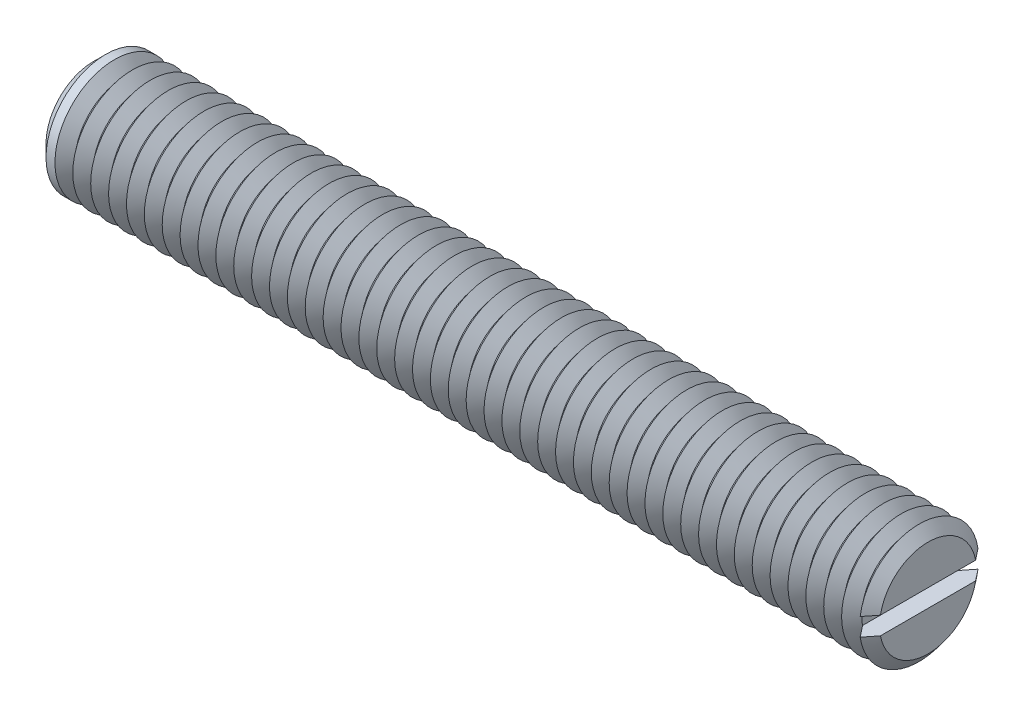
from build123d import *

# Parameters (mm, degrees)
SKETCH1_R       = 5
EXTRUDE1_DEPTH  = 35
SKETCH2_W       = 1.5
SKETCH2_H       = 1.5
EXTRUDE2_DEPTH  = 7.5
CHAMFER1_SIZE   = 1
LPATTERN1_COUNT = 46
LPATTERN1_PITCH = 1.5


with BuildPart() as part:
    # Sketch1 → Extrude1 (new, symmetric)
    with BuildSketch(Plane(origin=(0, 0, 0), x_dir=(0, 0, -1), z_dir=(1, 0, 0))):
        Circle(SKETCH1_R)
    extrude(amount=EXTRUDE1_DEPTH, both=True)

    # Sketch2 → Extrude2 (cut, symmetric)
    with BuildSketch(Plane.XY):
        with Locations((34.25, 0)):
            Rectangle(SKETCH2_W, SKETCH2_H)
    extrude(amount=EXTRUDE2_DEPTH, both=True, mode=Mode.SUBTRACT)

    # Chamfer1
    chamfer1_edges = [part.edges().sort_by_distance(p)[0] for p in [
        (-35, 0, 5),
    ]]
    chamfer(chamfer1_edges, length=CHAMFER1_SIZE)

    # Sketch3 → Cut-Revolve1 (revolve, cut)
    with BuildSketch(Plane.XY, mode=Mode.PRIVATE) as cut_revolve1_sk:
        Polygon((34.25, -5), (35.75, -5), (35, -4.0632503), align=None)
    cut_revolve1 = revolve(cut_revolve1_sk.sketch.rotate(Axis((0, 0, 0), (1, 0, 0)), 261.373073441), axis=Axis((0, 0, 0), (1, 0, 0)), mode=Mode.SUBTRACT)

    # LPattern1: Cut-Revolve1 ×46
    with Locations(*[(-i * LPATTERN1_PITCH, 0, 0) for i in range(1, LPATTERN1_COUNT)]):
        add(cut_revolve1, mode=Mode.SUBTRACT)


solid = part.part
